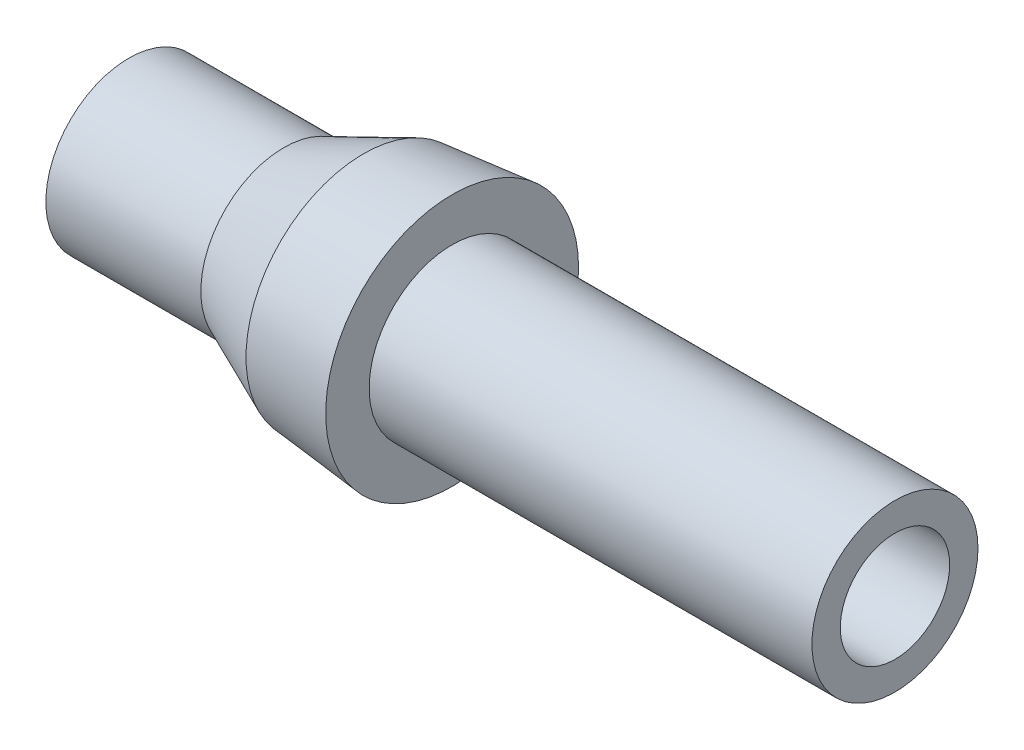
from build123d import *

# Parameters (mm, degrees)
SKETCH2_R          = 1.56845
CUT_EXTRUDE1_DEPTH = 23.561436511


with BuildPart() as part:
    # Sketch1 → Revolve1 (revolve)
    with BuildSketch(Plane(origin=(0, 0, 0), x_dir=(1, 0, 0), z_dir=(0, 1, 0))):
        Polygon((0, 0), (0, 2.38125), (4.445, 2.38125), (6.731, 3.37185), (9.271, 3.62585), (9.271, 2.38125), (21.971, 2.38125), (21.971, 0), align=None)
    revolve(axis=Axis((21.971, 0, 0), (-1, 0, 0)))

    # Sketch2 → Cut-Extrude1 (cut, through all)
    with BuildSketch(Plane(origin=(21.971, 0, 0), x_dir=(0, 0, -1), z_dir=(1, 0, 0))):
        Circle(SKETCH2_R)
    extrude(amount=-CUT_EXTRUDE1_DEPTH, mode=Mode.SUBTRACT)


solid = part.part
